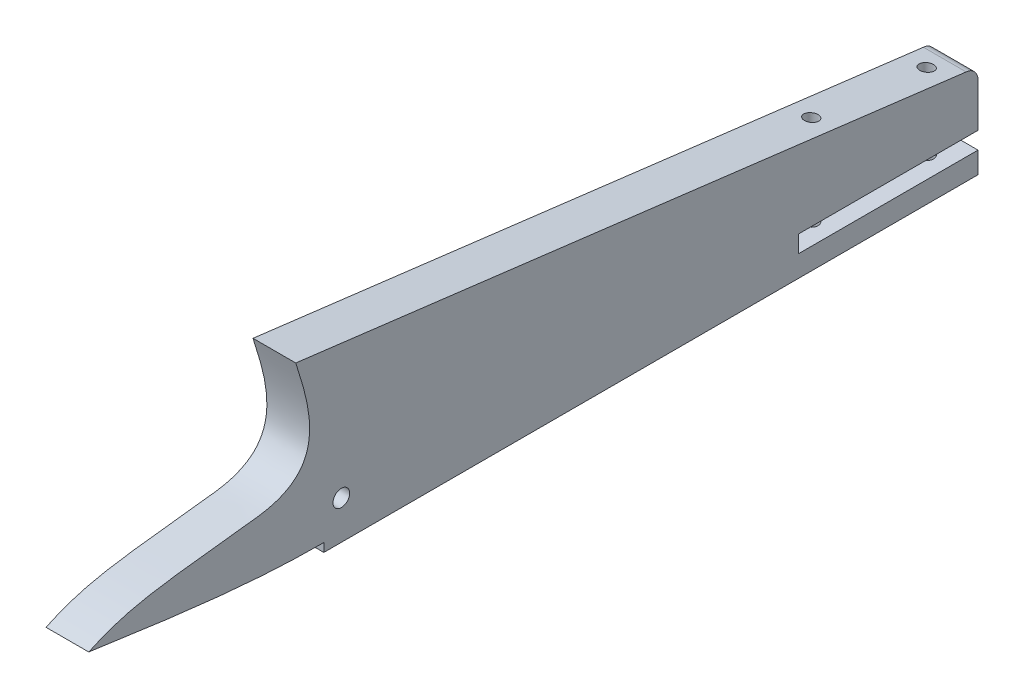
ISO-10303-21;
HEADER;
FILE_DESCRIPTION(('STEP AP214'),'2;1');
FILE_NAME('part.step','',(''),(''),'','','');
FILE_SCHEMA(('AUTOMOTIVE_DESIGN { 1 0 10303 214 1 1 1 1 }'));
ENDSEC;
DATA;
#1=APPLICATION_CONTEXT('core data for automotive mechanical design processes');
#2=APPLICATION_PROTOCOL_DEFINITION('international standard','automotive_design',2000,#1);
#3=PRODUCT_CONTEXT('',#1,'mechanical');
#4=PRODUCT('Part','Part','',(#3));
#5=PRODUCT_RELATED_PRODUCT_CATEGORY('part','',(#4));
#6=PRODUCT_DEFINITION_FORMATION('','',#4);
#7=PRODUCT_DEFINITION_CONTEXT('part definition',#1,'design');
#8=PRODUCT_DEFINITION('design','',#6,#7);
#9=PRODUCT_DEFINITION_SHAPE('','',#8);
#10=(LENGTH_UNIT() NAMED_UNIT(*) SI_UNIT(.MILLI.,.METRE.));
#11=(NAMED_UNIT(*) PLANE_ANGLE_UNIT() SI_UNIT($,.RADIAN.));
#12=(NAMED_UNIT(*) SI_UNIT($,.STERADIAN.) SOLID_ANGLE_UNIT());
#13=UNCERTAINTY_MEASURE_WITH_UNIT(LENGTH_MEASURE(1.E-05),#10,'distance_accuracy_value','');
#14=(GEOMETRIC_REPRESENTATION_CONTEXT(3) GLOBAL_UNCERTAINTY_ASSIGNED_CONTEXT((#13)) GLOBAL_UNIT_ASSIGNED_CONTEXT((#10,
#11,#12)) REPRESENTATION_CONTEXT('',''));
#15=CARTESIAN_POINT('',(0.,0.,0.));
#16=DIRECTION('',(0.,0.,1.));
#17=DIRECTION('',(1.,0.,0.));
#18=AXIS2_PLACEMENT_3D('',#15,#16,#17);
#19=CARTESIAN_POINT('',(10.,3.68129752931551,-119.62378639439));
#20=DIRECTION('',(1.,0.,0.));
#21=DIRECTION('',(0.,0.,-1.));
#22=AXIS2_PLACEMENT_3D('',#19,#20,#21);
#23=PLANE('',#22);
#24=CARTESIAN_POINT('',(10.,7.32944707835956,-92.0180268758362));
#25=CARTESIAN_POINT('',(10.,4.69738072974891,-110.515139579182));
#26=CARTESIAN_POINT('',(10.,2.00959698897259,-128.808948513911));
#27=CARTESIAN_POINT('',(10.,2.,-147.));
#28=B_SPLINE_CURVE_WITH_KNOTS('',3,(#24,#25,#26,#27),.UNSPECIFIED.,.F.,.F.,(4,4),
(0.628986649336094,1.),.UNSPECIFIED.);
#29=CARTESIAN_POINT('',(10.,7.32944707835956,-92.0180268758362));
#30=VERTEX_POINT('',#29);
#31=CARTESIAN_POINT('',(10.,2.,-147.));
#32=VERTEX_POINT('',#31);
#33=EDGE_CURVE('E235',#30,#32,#28,.T.);
#34=ORIENTED_EDGE('',*,*,#33,.T.);
#35=DIRECTION('',(0.,-1.,0.));
#36=VECTOR('',#35,1.);
#37=CARTESIAN_POINT('',(10.,0.,-147.));
#38=LINE('',#37,#36);
#39=CARTESIAN_POINT('',(10.,0.,-147.));
#40=VERTEX_POINT('',#39);
#41=EDGE_CURVE('E243',#32,#40,#38,.T.);
#42=ORIENTED_EDGE('',*,*,#41,.T.);
#43=DIRECTION('',(0.,0.,-1.));
#44=VECTOR('',#43,1.);
#45=CARTESIAN_POINT('',(10.,0.,-300.));
#46=LINE('',#45,#44);
#47=CARTESIAN_POINT('',(10.,0.,-300.));
#48=VERTEX_POINT('',#47);
#49=EDGE_CURVE('E248',#40,#48,#46,.T.);
#50=ORIENTED_EDGE('',*,*,#49,.T.);
#51=DIRECTION('',(0.,1.,0.));
#52=VECTOR('',#51,1.);
#53=CARTESIAN_POINT('',(10.,5.,-300.));
#54=LINE('',#53,#52);
#55=CARTESIAN_POINT('',(10.,5.,-300.));
#56=VERTEX_POINT('',#55);
#57=EDGE_CURVE('E250',#48,#56,#54,.T.);
#58=ORIENTED_EDGE('',*,*,#57,.T.);
#59=DIRECTION('',(0.,0.,1.));
#60=VECTOR('',#59,1.);
#61=CARTESIAN_POINT('',(10.,5.,-258.));
#62=LINE('',#61,#60);
#63=CARTESIAN_POINT('',(10.,5.,-258.));
#64=VERTEX_POINT('',#63);
#65=EDGE_CURVE('E252',#56,#64,#62,.T.);
#66=ORIENTED_EDGE('',*,*,#65,.T.);
#67=DIRECTION('',(0.,1.,0.));
#68=VECTOR('',#67,1.);
#69=CARTESIAN_POINT('',(10.,9.,-258.));
#70=LINE('',#69,#68);
#71=CARTESIAN_POINT('',(10.,9.,-258.));
#72=VERTEX_POINT('',#71);
#73=EDGE_CURVE('E254',#64,#72,#70,.T.);
#74=ORIENTED_EDGE('',*,*,#73,.T.);
#75=DIRECTION('',(0.,0.,-1.));
#76=VECTOR('',#75,1.);
#77=CARTESIAN_POINT('',(10.,9.,-300.));
#78=LINE('',#77,#76);
#79=CARTESIAN_POINT('',(10.,9.,-300.));
#80=VERTEX_POINT('',#79);
#81=EDGE_CURVE('E256',#72,#80,#78,.T.);
#82=ORIENTED_EDGE('',*,*,#81,.T.);
#83=DIRECTION('',(0.,1.,0.));
#84=VECTOR('',#83,1.);
#85=CARTESIAN_POINT('',(10.,19.2277736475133,-300.));
#86=LINE('',#85,#84);
#87=CARTESIAN_POINT('',(10.,19.2277736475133,-300.));
#88=VERTEX_POINT('',#87);
#89=EDGE_CURVE('E258',#80,#88,#86,.T.);
#90=ORIENTED_EDGE('',*,*,#89,.T.);
#91=CARTESIAN_POINT('',(10.,19.2277736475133,-297.));
#92=DIRECTION('',(1.,0.,0.));
#93=DIRECTION('',(0.,0.,1.));
#94=AXIS2_PLACEMENT_3D('',#91,#92,#93);
#95=CIRCLE('',#94,3.);
#96=CARTESIAN_POINT('',(10.,22.2184454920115,-297.236393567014));
#97=VERTEX_POINT('',#96);
#98=EDGE_CURVE('E260',#88,#97,#95,.T.);
#99=ORIENTED_EDGE('',*,*,#98,.T.);
#100=DIRECTION('',(0.,0.123054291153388,0.992399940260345));
#101=VECTOR('',#100,1.);
#102=CARTESIAN_POINT('',(10.,22.2184454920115,-297.236393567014));
#103=LINE('',#102,#101);
#104=CARTESIAN_POINT('',(10.,41.6613306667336,-140.434725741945));
#105=VERTEX_POINT('',#104);
#106=EDGE_CURVE('E262',#97,#105,#103,.T.);
#107=ORIENTED_EDGE('',*,*,#106,.T.);
#108=CARTESIAN_POINT('',(10.,41.6613306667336,-140.434725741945));
#109=CARTESIAN_POINT('',(10.,29.0416337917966,-144.54962945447));
#110=CARTESIAN_POINT('',(10.,16.8225612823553,-147.619938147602));
#111=CARTESIAN_POINT('',(10.,12.2812139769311,-108.316019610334));
#112=CARTESIAN_POINT('',(10.,11.7918969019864,-101.612446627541));
#113=CARTESIAN_POINT('',(10.,7.32944707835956,-92.0180268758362));
#114=B_SPLINE_CURVE_WITH_KNOTS('',3,(#108,#109,#110,#111,#112,#113),.UNSPECIFIED.,.F.,.F.,(4,2,
4),(0.115839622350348,0.48118059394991,0.980332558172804),.UNSPECIFIED.);
#115=EDGE_CURVE('E58',#105,#30,#114,.T.);
#116=ORIENTED_EDGE('',*,*,#115,.T.);
#117=EDGE_LOOP('',(#34,#42,#50,#58,#66,#74,#82,#90,#99,#107,#116));
#118=FACE_BOUND('',#117,.T.);
#119=CARTESIAN_POINT('',(10.,9.,-151.089942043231));
#120=DIRECTION('',(1.,0.,0.));
#121=DIRECTION('',(0.,0.,-1.));
#122=AXIS2_PLACEMENT_3D('',#119,#120,#121);
#123=CIRCLE('',#122,1.95);
#124=CARTESIAN_POINT('',(10.,9.,-153.039942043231));
#125=VERTEX_POINT('',#124);
#126=EDGE_CURVE('E203',#125,#125,#123,.T.);
#127=ORIENTED_EDGE('',*,*,#126,.F.);
#128=EDGE_LOOP('',(#127));
#129=FACE_BOUND('',#128,.T.);
#130=ADVANCED_FACE('F32',(#118,#129),#23,.T.);
#131=CARTESIAN_POINT('',(0.,3.68129752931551,-119.62378639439));
#132=DIRECTION('',(1.,0.,0.));
#133=DIRECTION('',(0.,0.,-1.));
#134=AXIS2_PLACEMENT_3D('',#131,#132,#133);
#135=PLANE('',#134);
#136=CARTESIAN_POINT('',(0.,7.32944707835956,-92.0180268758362));
#137=CARTESIAN_POINT('',(0.,4.69738072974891,-110.515139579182));
#138=CARTESIAN_POINT('',(0.,2.00959698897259,-128.808948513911));
#139=CARTESIAN_POINT('',(0.,2.,-147.));
#140=B_SPLINE_CURVE_WITH_KNOTS('',3,(#136,#137,#138,#139),.UNSPECIFIED.,.F.,.F.,(4,4),
(0.628986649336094,1.),.UNSPECIFIED.);
#141=CARTESIAN_POINT('',(0.,7.32944707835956,-92.0180268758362));
#142=VERTEX_POINT('',#141);
#143=CARTESIAN_POINT('',(0.,2.,-147.));
#144=VERTEX_POINT('',#143);
#145=EDGE_CURVE('E206',#142,#144,#140,.T.);
#146=ORIENTED_EDGE('',*,*,#145,.F.);
#147=CARTESIAN_POINT('',(0.,41.6613306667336,-140.434725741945));
#148=CARTESIAN_POINT('',(0.,29.0416337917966,-144.54962945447));
#149=CARTESIAN_POINT('',(0.,16.8225612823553,-147.619938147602));
#150=CARTESIAN_POINT('',(0.,12.2812139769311,-108.316019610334));
#151=CARTESIAN_POINT('',(0.,11.7918969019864,-101.612446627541));
#152=CARTESIAN_POINT('',(0.,7.32944707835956,-92.0180268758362));
#153=B_SPLINE_CURVE_WITH_KNOTS('',3,(#147,#148,#149,#150,#151,#152),.UNSPECIFIED.,.F.,.F.,(4,2,
4),(0.115839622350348,0.48118059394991,0.980332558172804),.UNSPECIFIED.);
#154=CARTESIAN_POINT('',(0.,41.6613306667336,-140.434725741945));
#155=VERTEX_POINT('',#154);
#156=EDGE_CURVE('E232',#155,#142,#153,.T.);
#157=ORIENTED_EDGE('',*,*,#156,.F.);
#158=DIRECTION('',(0.,0.123054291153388,0.992399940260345));
#159=VECTOR('',#158,1.);
#160=CARTESIAN_POINT('',(0.,22.2184454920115,-297.236393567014));
#161=LINE('',#160,#159);
#162=CARTESIAN_POINT('',(0.,22.2184454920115,-297.236393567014));
#163=VERTEX_POINT('',#162);
#164=EDGE_CURVE('E230',#163,#155,#161,.T.);
#165=ORIENTED_EDGE('',*,*,#164,.F.);
#166=CARTESIAN_POINT('',(0.,19.2277736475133,-297.));
#167=DIRECTION('',(1.,0.,0.));
#168=DIRECTION('',(0.,0.,1.));
#169=AXIS2_PLACEMENT_3D('',#166,#167,#168);
#170=CIRCLE('',#169,3.);
#171=CARTESIAN_POINT('',(0.,19.2277736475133,-300.));
#172=VERTEX_POINT('',#171);
#173=EDGE_CURVE('E228',#172,#163,#170,.T.);
#174=ORIENTED_EDGE('',*,*,#173,.F.);
#175=DIRECTION('',(0.,1.,0.));
#176=VECTOR('',#175,1.);
#177=CARTESIAN_POINT('',(0.,19.2277736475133,-300.));
#178=LINE('',#177,#176);
#179=CARTESIAN_POINT('',(0.,9.,-300.));
#180=VERTEX_POINT('',#179);
#181=EDGE_CURVE('E226',#180,#172,#178,.T.);
#182=ORIENTED_EDGE('',*,*,#181,.F.);
#183=DIRECTION('',(0.,0.,-1.));
#184=VECTOR('',#183,1.);
#185=CARTESIAN_POINT('',(0.,9.,-300.));
#186=LINE('',#185,#184);
#187=CARTESIAN_POINT('',(0.,9.,-258.));
#188=VERTEX_POINT('',#187);
#189=EDGE_CURVE('E224',#188,#180,#186,.T.);
#190=ORIENTED_EDGE('',*,*,#189,.F.);
#191=DIRECTION('',(0.,1.,0.));
#192=VECTOR('',#191,1.);
#193=CARTESIAN_POINT('',(0.,9.,-258.));
#194=LINE('',#193,#192);
#195=CARTESIAN_POINT('',(0.,5.,-258.));
#196=VERTEX_POINT('',#195);
#197=EDGE_CURVE('E222',#196,#188,#194,.T.);
#198=ORIENTED_EDGE('',*,*,#197,.F.);
#199=DIRECTION('',(0.,0.,1.));
#200=VECTOR('',#199,1.);
#201=CARTESIAN_POINT('',(0.,5.,-258.));
#202=LINE('',#201,#200);
#203=CARTESIAN_POINT('',(0.,5.,-300.));
#204=VERTEX_POINT('',#203);
#205=EDGE_CURVE('E220',#204,#196,#202,.T.);
#206=ORIENTED_EDGE('',*,*,#205,.F.);
#207=DIRECTION('',(0.,1.,0.));
#208=VECTOR('',#207,1.);
#209=CARTESIAN_POINT('',(0.,5.,-300.));
#210=LINE('',#209,#208);
#211=CARTESIAN_POINT('',(0.,0.,-300.));
#212=VERTEX_POINT('',#211);
#213=EDGE_CURVE('E218',#212,#204,#210,.T.);
#214=ORIENTED_EDGE('',*,*,#213,.F.);
#215=DIRECTION('',(0.,0.,-1.));
#216=VECTOR('',#215,1.);
#217=CARTESIAN_POINT('',(0.,0.,-300.));
#218=LINE('',#217,#216);
#219=CARTESIAN_POINT('',(0.,0.,-147.));
#220=VERTEX_POINT('',#219);
#221=EDGE_CURVE('E216',#220,#212,#218,.T.);
#222=ORIENTED_EDGE('',*,*,#221,.F.);
#223=DIRECTION('',(0.,-1.,0.));
#224=VECTOR('',#223,1.);
#225=CARTESIAN_POINT('',(0.,0.,-147.));
#226=LINE('',#225,#224);
#227=EDGE_CURVE('E211',#144,#220,#226,.T.);
#228=ORIENTED_EDGE('',*,*,#227,.F.);
#229=EDGE_LOOP('',(#146,#157,#165,#174,#182,#190,#198,#206,#214,#222,#228));
#230=FACE_BOUND('',#229,.T.);
#231=CARTESIAN_POINT('',(0.,9.,-151.089942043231));
#232=DIRECTION('',(1.,0.,0.));
#233=DIRECTION('',(0.,0.,-1.));
#234=AXIS2_PLACEMENT_3D('',#231,#232,#233);
#235=CIRCLE('',#234,1.95);
#236=CARTESIAN_POINT('',(0.,9.,-153.039942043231));
#237=VERTEX_POINT('',#236);
#238=EDGE_CURVE('E200',#237,#237,#235,.T.);
#239=ORIENTED_EDGE('',*,*,#238,.T.);
#240=EDGE_LOOP('',(#239));
#241=FACE_BOUND('',#240,.T.);
#242=ADVANCED_FACE('F318',(#230,#241),#135,.F.);
#243=DIRECTION('',(-1.,0.,0.));
#244=VECTOR('',#243,1.);
#245=SURFACE_OF_LINEAR_EXTRUSION('',#28,#244);
#246=ORIENTED_EDGE('',*,*,#145,.T.);
#247=DIRECTION('',(-1.,0.,0.));
#248=VECTOR('',#247,1.);
#249=CARTESIAN_POINT('',(10.,2.,-147.));
#250=LINE('',#249,#248);
#251=EDGE_CURVE('E11',#32,#144,#250,.T.);
#252=ORIENTED_EDGE('',*,*,#251,.F.);
#253=ORIENTED_EDGE('',*,*,#33,.F.);
#254=DIRECTION('',(-1.,0.,0.));
#255=VECTOR('',#254,1.);
#256=CARTESIAN_POINT('',(10.,7.32944707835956,-92.0180268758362));
#257=LINE('',#256,#255);
#258=EDGE_CURVE('E268',#30,#142,#257,.T.);
#259=ORIENTED_EDGE('',*,*,#258,.T.);
#260=EDGE_LOOP('',(#246,#252,#253,#259));
#261=FACE_BOUND('',#260,.T.);
#262=ADVANCED_FACE('F34',(#261),#245,.F.);
#263=CARTESIAN_POINT('',(10.,0.,-147.));
#264=DIRECTION('',(0.,0.,-1.));
#265=DIRECTION('',(0.,1.,0.));
#266=AXIS2_PLACEMENT_3D('',#263,#264,#265);
#267=PLANE('',#266);
#268=ORIENTED_EDGE('',*,*,#227,.T.);
#269=DIRECTION('',(-1.,0.,0.));
#270=VECTOR('',#269,1.);
#271=CARTESIAN_POINT('',(10.,0.,-147.));
#272=LINE('',#271,#270);
#273=EDGE_CURVE('E42',#40,#220,#272,.T.);
#274=ORIENTED_EDGE('',*,*,#273,.F.);
#275=ORIENTED_EDGE('',*,*,#41,.F.);
#276=ORIENTED_EDGE('',*,*,#251,.T.);
#277=EDGE_LOOP('',(#268,#274,#275,#276));
#278=FACE_BOUND('',#277,.T.);
#279=ADVANCED_FACE('F311',(#278),#267,.F.);
#280=CARTESIAN_POINT('',(10.,0.,-300.));
#281=DIRECTION('',(0.,1.,0.));
#282=DIRECTION('',(0.,0.,1.));
#283=AXIS2_PLACEMENT_3D('',#280,#281,#282);
#284=PLANE('',#283);
#285=DIRECTION('',(1.,0.,0.));
#286=VECTOR('',#285,1.);
#287=CARTESIAN_POINT('',(2.5,0.,-250.5));
#288=LINE('',#287,#286);
#289=CARTESIAN_POINT('',(2.5,0.,-250.5));
#290=VERTEX_POINT('',#289);
#291=CARTESIAN_POINT('',(7.5,0.,-250.5));
#292=VERTEX_POINT('',#291);
#293=EDGE_CURVE('E172',#290,#292,#288,.T.);
#294=ORIENTED_EDGE('',*,*,#293,.F.);
#295=CARTESIAN_POINT('',(2.5,0.,-250.));
#296=DIRECTION('',(0.,-1.,0.));
#297=DIRECTION('',(0.,0.,-1.));
#298=AXIS2_PLACEMENT_3D('',#295,#296,#297);
#299=CIRCLE('',#298,0.5);
#300=CARTESIAN_POINT('',(2.5,0.,-249.5));
#301=VERTEX_POINT('',#300);
#302=EDGE_CURVE('E50',#301,#290,#299,.T.);
#303=ORIENTED_EDGE('',*,*,#302,.F.);
#304=DIRECTION('',(-1.,0.,0.));
#305=VECTOR('',#304,1.);
#306=CARTESIAN_POINT('',(7.5,0.,-249.5));
#307=LINE('',#306,#305);
#308=CARTESIAN_POINT('',(7.5,0.,-249.5));
#309=VERTEX_POINT('',#308);
#310=EDGE_CURVE('E163',#309,#301,#307,.T.);
#311=ORIENTED_EDGE('',*,*,#310,.F.);
#312=CARTESIAN_POINT('',(7.5,0.,-250.));
#313=DIRECTION('',(0.,-1.,0.));
#314=DIRECTION('',(0.,0.,-1.));
#315=AXIS2_PLACEMENT_3D('',#312,#313,#314);
#316=CIRCLE('',#315,0.5);
#317=EDGE_CURVE('E166',#292,#309,#316,.T.);
#318=ORIENTED_EDGE('',*,*,#317,.F.);
#319=EDGE_LOOP('',(#294,#303,#311,#318));
#320=FACE_BOUND('',#319,.T.);
#321=CARTESIAN_POINT('',(5.,0.,-266.));
#322=DIRECTION('',(0.,-1.,0.));
#323=DIRECTION('',(0.,0.,-1.));
#324=AXIS2_PLACEMENT_3D('',#321,#322,#323);
#325=CIRCLE('',#324,1.6);
#326=CARTESIAN_POINT('',(5.,0.,-267.6));
#327=VERTEX_POINT('',#326);
#328=EDGE_CURVE('E178',#327,#327,#325,.T.);
#329=ORIENTED_EDGE('',*,*,#328,.F.);
#330=EDGE_LOOP('',(#329));
#331=FACE_BOUND('',#330,.T.);
#332=CARTESIAN_POINT('',(5.,0.,-293.));
#333=DIRECTION('',(0.,-1.,0.));
#334=DIRECTION('',(0.,0.,-1.));
#335=AXIS2_PLACEMENT_3D('',#332,#333,#334);
#336=CIRCLE('',#335,1.6);
#337=CARTESIAN_POINT('',(5.,0.,-294.6));
#338=VERTEX_POINT('',#337);
#339=EDGE_CURVE('E190',#338,#338,#336,.T.);
#340=ORIENTED_EDGE('',*,*,#339,.F.);
#341=EDGE_LOOP('',(#340));
#342=FACE_BOUND('',#341,.T.);
#343=ORIENTED_EDGE('',*,*,#221,.T.);
#344=DIRECTION('',(-1.,0.,0.));
#345=VECTOR('',#344,1.);
#346=CARTESIAN_POINT('',(10.,0.,-300.));
#347=LINE('',#346,#345);
#348=EDGE_CURVE('E542',#48,#212,#347,.T.);
#349=ORIENTED_EDGE('',*,*,#348,.F.);
#350=ORIENTED_EDGE('',*,*,#49,.F.);
#351=ORIENTED_EDGE('',*,*,#273,.T.);
#352=EDGE_LOOP('',(#343,#349,#350,#351));
#353=FACE_BOUND('',#352,.T.);
#354=ADVANCED_FACE('F308',(#320,#331,#342,#353),#284,.F.);
#355=CARTESIAN_POINT('',(10.,5.,-300.));
#356=DIRECTION('',(0.,0.,1.));
#357=DIRECTION('',(1.,0.,0.));
#358=AXIS2_PLACEMENT_3D('',#355,#356,#357);
#359=PLANE('',#358);
#360=ORIENTED_EDGE('',*,*,#213,.T.);
#361=DIRECTION('',(-1.,0.,0.));
#362=VECTOR('',#361,1.);
#363=CARTESIAN_POINT('',(10.,5.,-300.));
#364=LINE('',#363,#362);
#365=EDGE_CURVE('E539',#56,#204,#364,.T.);
#366=ORIENTED_EDGE('',*,*,#365,.F.);
#367=ORIENTED_EDGE('',*,*,#57,.F.);
#368=ORIENTED_EDGE('',*,*,#348,.T.);
#369=EDGE_LOOP('',(#360,#366,#367,#368));
#370=FACE_BOUND('',#369,.T.);
#371=ADVANCED_FACE('F304',(#370),#359,.F.);
#372=CARTESIAN_POINT('',(10.,5.,-258.));
#373=DIRECTION('',(0.,-1.,0.));
#374=DIRECTION('',(0.,0.,-1.));
#375=AXIS2_PLACEMENT_3D('',#372,#373,#374);
#376=PLANE('',#375);
#377=CARTESIAN_POINT('',(5.,5.,-266.));
#378=DIRECTION('',(0.,-1.,0.));
#379=DIRECTION('',(0.,0.,-1.));
#380=AXIS2_PLACEMENT_3D('',#377,#378,#379);
#381=CIRCLE('',#380,1.6);
#382=CARTESIAN_POINT('',(5.,5.,-267.6));
#383=VERTEX_POINT('',#382);
#384=EDGE_CURVE('E187',#383,#383,#381,.T.);
#385=ORIENTED_EDGE('',*,*,#384,.T.);
#386=EDGE_LOOP('',(#385));
#387=FACE_BOUND('',#386,.T.);
#388=CARTESIAN_POINT('',(5.,5.,-293.));
#389=DIRECTION('',(0.,-1.,0.));
#390=DIRECTION('',(0.,0.,-1.));
#391=AXIS2_PLACEMENT_3D('',#388,#389,#390);
#392=CIRCLE('',#391,1.6);
#393=CARTESIAN_POINT('',(5.,5.,-294.6));
#394=VERTEX_POINT('',#393);
#395=EDGE_CURVE('E197',#394,#394,#392,.T.);
#396=ORIENTED_EDGE('',*,*,#395,.T.);
#397=EDGE_LOOP('',(#396));
#398=FACE_BOUND('',#397,.T.);
#399=ORIENTED_EDGE('',*,*,#205,.T.);
#400=DIRECTION('',(-1.,0.,0.));
#401=VECTOR('',#400,1.);
#402=CARTESIAN_POINT('',(10.,5.,-258.));
#403=LINE('',#402,#401);
#404=EDGE_CURVE('E536',#64,#196,#403,.T.);
#405=ORIENTED_EDGE('',*,*,#404,.F.);
#406=ORIENTED_EDGE('',*,*,#65,.F.);
#407=ORIENTED_EDGE('',*,*,#365,.T.);
#408=EDGE_LOOP('',(#399,#405,#406,#407));
#409=FACE_BOUND('',#408,.T.);
#410=ADVANCED_FACE('F300',(#387,#398,#409),#376,.F.);
#411=CARTESIAN_POINT('',(10.,9.,-258.));
#412=DIRECTION('',(0.,0.,1.));
#413=DIRECTION('',(1.,0.,0.));
#414=AXIS2_PLACEMENT_3D('',#411,#412,#413);
#415=PLANE('',#414);
#416=ORIENTED_EDGE('',*,*,#197,.T.);
#417=DIRECTION('',(-1.,0.,0.));
#418=VECTOR('',#417,1.);
#419=CARTESIAN_POINT('',(10.,9.,-258.));
#420=LINE('',#419,#418);
#421=EDGE_CURVE('E512',#72,#188,#420,.T.);
#422=ORIENTED_EDGE('',*,*,#421,.F.);
#423=ORIENTED_EDGE('',*,*,#73,.F.);
#424=ORIENTED_EDGE('',*,*,#404,.T.);
#425=EDGE_LOOP('',(#416,#422,#423,#424));
#426=FACE_BOUND('',#425,.T.);
#427=ADVANCED_FACE('F296',(#426),#415,.F.);
#428=CARTESIAN_POINT('',(10.,9.,-300.));
#429=DIRECTION('',(0.,1.,0.));
#430=DIRECTION('',(0.,0.,1.));
#431=AXIS2_PLACEMENT_3D('',#428,#429,#430);
#432=PLANE('',#431);
#433=CARTESIAN_POINT('',(5.,9.,-266.));
#434=DIRECTION('',(0.,1.,0.));
#435=DIRECTION('',(0.,0.,1.));
#436=AXIS2_PLACEMENT_3D('',#433,#434,#435);
#437=CIRCLE('',#436,1.6);
#438=CARTESIAN_POINT('',(5.,9.,-264.4));
#439=VERTEX_POINT('',#438);
#440=EDGE_CURVE('E184',#439,#439,#437,.T.);
#441=ORIENTED_EDGE('',*,*,#440,.T.);
#442=EDGE_LOOP('',(#441));
#443=FACE_BOUND('',#442,.T.);
#444=CARTESIAN_POINT('',(5.,9.,-293.));
#445=DIRECTION('',(0.,1.,0.));
#446=DIRECTION('',(0.,0.,1.));
#447=AXIS2_PLACEMENT_3D('',#444,#445,#446);
#448=CIRCLE('',#447,1.6);
#449=CARTESIAN_POINT('',(5.,9.,-291.4));
#450=VERTEX_POINT('',#449);
#451=EDGE_CURVE('E194',#450,#450,#448,.T.);
#452=ORIENTED_EDGE('',*,*,#451,.T.);
#453=EDGE_LOOP('',(#452));
#454=FACE_BOUND('',#453,.T.);
#455=ORIENTED_EDGE('',*,*,#189,.T.);
#456=DIRECTION('',(-1.,0.,0.));
#457=VECTOR('',#456,1.);
#458=CARTESIAN_POINT('',(10.,9.,-300.));
#459=LINE('',#458,#457);
#460=EDGE_CURVE('E509',#80,#180,#459,.T.);
#461=ORIENTED_EDGE('',*,*,#460,.F.);
#462=ORIENTED_EDGE('',*,*,#81,.F.);
#463=ORIENTED_EDGE('',*,*,#421,.T.);
#464=EDGE_LOOP('',(#455,#461,#462,#463));
#465=FACE_BOUND('',#464,.T.);
#466=ADVANCED_FACE('F292',(#443,#454,#465),#432,.F.);
#467=CARTESIAN_POINT('',(10.,19.2277736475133,-300.));
#468=DIRECTION('',(0.,0.,1.));
#469=DIRECTION('',(1.,0.,0.));
#470=AXIS2_PLACEMENT_3D('',#467,#468,#469);
#471=PLANE('',#470);
#472=ORIENTED_EDGE('',*,*,#181,.T.);
#473=DIRECTION('',(-1.,0.,0.));
#474=VECTOR('',#473,1.);
#475=CARTESIAN_POINT('',(10.,19.2277736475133,-300.));
#476=LINE('',#475,#474);
#477=EDGE_CURVE('E517',#88,#172,#476,.T.);
#478=ORIENTED_EDGE('',*,*,#477,.F.);
#479=ORIENTED_EDGE('',*,*,#89,.F.);
#480=ORIENTED_EDGE('',*,*,#460,.T.);
#481=EDGE_LOOP('',(#472,#478,#479,#480));
#482=FACE_BOUND('',#481,.T.);
#483=ADVANCED_FACE('F288',(#482),#471,.F.);
#484=CARTESIAN_POINT('',(10.,19.2277736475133,-297.));
#485=DIRECTION('',(-1.,0.,0.));
#486=DIRECTION('',(0.,0.,1.));
#487=AXIS2_PLACEMENT_3D('',#484,#485,#486);
#488=CYLINDRICAL_SURFACE('',#487,3.);
#489=ORIENTED_EDGE('',*,*,#173,.T.);
#490=DIRECTION('',(-1.,0.,0.));
#491=VECTOR('',#490,1.);
#492=CARTESIAN_POINT('',(10.,22.2184454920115,-297.236393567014));
#493=LINE('',#492,#491);
#494=EDGE_CURVE('E526',#97,#163,#493,.T.);
#495=ORIENTED_EDGE('',*,*,#494,.F.);
#496=ORIENTED_EDGE('',*,*,#98,.F.);
#497=ORIENTED_EDGE('',*,*,#477,.T.);
#498=EDGE_LOOP('',(#489,#495,#496,#497));
#499=FACE_BOUND('',#498,.T.);
#500=ADVANCED_FACE('F284',(#499),#488,.T.);
#501=CARTESIAN_POINT('',(10.,22.2184454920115,-297.236393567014));
#502=DIRECTION('',(0.,-0.992399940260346,0.123054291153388));
#503=DIRECTION('',(0.,-0.123054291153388,-0.992399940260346));
#504=AXIS2_PLACEMENT_3D('',#501,#502,#503);
#505=PLANE('',#504);
#506=CARTESIAN_POINT('',(5.,26.0916543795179,-266.));
#507=DIRECTION('',(0.,-0.992399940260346,0.123054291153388));
#508=DIRECTION('',(0.,-0.123054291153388,-0.992399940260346));
#509=AXIS2_PLACEMENT_3D('',#506,#507,#508);
#510=ELLIPSE('',#509,1.61225322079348,1.6);
#511=CARTESIAN_POINT('',(5.,25.8932597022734,-267.6));
#512=VERTEX_POINT('',#511);
#513=EDGE_CURVE('E37',#512,#512,#510,.T.);
#514=ORIENTED_EDGE('',*,*,#513,.T.);
#515=EDGE_LOOP('',(#514));
#516=FACE_BOUND('',#515,.T.);
#517=CARTESIAN_POINT('',(5.,22.7437442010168,-293.));
#518=DIRECTION('',(0.,-0.992399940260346,0.123054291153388));
#519=DIRECTION('',(0.,-0.123054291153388,-0.992399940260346));
#520=AXIS2_PLACEMENT_3D('',#517,#518,#519);
#521=ELLIPSE('',#520,1.61225322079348,1.6);
#522=CARTESIAN_POINT('',(5.,22.5453495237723,-294.6));
#523=VERTEX_POINT('',#522);
#524=EDGE_CURVE('E193',#523,#523,#521,.T.);
#525=ORIENTED_EDGE('',*,*,#524,.T.);
#526=EDGE_LOOP('',(#525));
#527=FACE_BOUND('',#526,.T.);
#528=ORIENTED_EDGE('',*,*,#164,.T.);
#529=DIRECTION('',(-1.,0.,0.));
#530=VECTOR('',#529,1.);
#531=CARTESIAN_POINT('',(10.,41.6613306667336,-140.434725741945));
#532=LINE('',#531,#530);
#533=EDGE_CURVE('E531',#105,#155,#532,.T.);
#534=ORIENTED_EDGE('',*,*,#533,.F.);
#535=ORIENTED_EDGE('',*,*,#106,.F.);
#536=ORIENTED_EDGE('',*,*,#494,.T.);
#537=EDGE_LOOP('',(#528,#534,#535,#536));
#538=FACE_BOUND('',#537,.T.);
#539=ADVANCED_FACE('F279',(#516,#527,#538),#505,.F.);
#540=DIRECTION('',(-1.,0.,0.));
#541=VECTOR('',#540,1.);
#542=SURFACE_OF_LINEAR_EXTRUSION('',#114,#541);
#543=ORIENTED_EDGE('',*,*,#156,.T.);
#544=ORIENTED_EDGE('',*,*,#258,.F.);
#545=ORIENTED_EDGE('',*,*,#115,.F.);
#546=ORIENTED_EDGE('',*,*,#533,.T.);
#547=EDGE_LOOP('',(#543,#544,#545,#546));
#548=FACE_BOUND('',#547,.T.);
#549=ADVANCED_FACE('F274',(#548),#542,.F.);
#550=CARTESIAN_POINT('',(10.,9.,-151.089942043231));
#551=DIRECTION('',(-1.,0.,0.));
#552=DIRECTION('',(0.,0.,1.));
#553=AXIS2_PLACEMENT_3D('',#550,#551,#552);
#554=CYLINDRICAL_SURFACE('',#553,1.95);
#555=ORIENTED_EDGE('',*,*,#126,.T.);
#556=EDGE_LOOP('',(#555));
#557=FACE_BOUND('',#556,.T.);
#558=ORIENTED_EDGE('',*,*,#238,.F.);
#559=EDGE_LOOP('',(#558));
#560=FACE_BOUND('',#559,.T.);
#561=ADVANCED_FACE('F278',(#557,#560),#554,.F.);
#562=CARTESIAN_POINT('',(5.,28.,-293.));
#563=DIRECTION('',(0.,-1.,0.));
#564=DIRECTION('',(0.,0.,-1.));
#565=AXIS2_PLACEMENT_3D('',#562,#563,#564);
#566=CYLINDRICAL_SURFACE('',#565,1.6);
#567=ORIENTED_EDGE('',*,*,#524,.F.);
#568=EDGE_LOOP('',(#567));
#569=FACE_BOUND('',#568,.T.);
#570=ORIENTED_EDGE('',*,*,#451,.F.);
#571=EDGE_LOOP('',(#570));
#572=FACE_BOUND('',#571,.T.);
#573=ADVANCED_FACE('F332',(#569,#572),#566,.F.);
#574=ORIENTED_EDGE('',*,*,#339,.T.);
#575=EDGE_LOOP('',(#574));
#576=FACE_BOUND('',#575,.T.);
#577=ORIENTED_EDGE('',*,*,#395,.F.);
#578=EDGE_LOOP('',(#577));
#579=FACE_BOUND('',#578,.T.);
#580=ADVANCED_FACE('F339',(#576,#579),#566,.F.);
#581=CARTESIAN_POINT('',(5.,28.,-266.));
#582=DIRECTION('',(0.,-1.,0.));
#583=DIRECTION('',(0.,0.,-1.));
#584=AXIS2_PLACEMENT_3D('',#581,#582,#583);
#585=CYLINDRICAL_SURFACE('',#584,1.6);
#586=ORIENTED_EDGE('',*,*,#513,.F.);
#587=EDGE_LOOP('',(#586));
#588=FACE_BOUND('',#587,.T.);
#589=ORIENTED_EDGE('',*,*,#440,.F.);
#590=EDGE_LOOP('',(#589));
#591=FACE_BOUND('',#590,.T.);
#592=ADVANCED_FACE('F344',(#588,#591),#585,.F.);
#593=ORIENTED_EDGE('',*,*,#328,.T.);
#594=EDGE_LOOP('',(#593));
#595=FACE_BOUND('',#594,.T.);
#596=ORIENTED_EDGE('',*,*,#384,.F.);
#597=EDGE_LOOP('',(#596));
#598=FACE_BOUND('',#597,.T.);
#599=ADVANCED_FACE('F346',(#595,#598),#585,.F.);
#600=CARTESIAN_POINT('',(2.5,8.,-250.));
#601=DIRECTION('',(0.,-1.,0.));
#602=DIRECTION('',(0.,0.,-1.));
#603=AXIS2_PLACEMENT_3D('',#600,#601,#602);
#604=CYLINDRICAL_SURFACE('',#603,0.5);
#605=ORIENTED_EDGE('',*,*,#302,.T.);
#606=DIRECTION('',(0.,-1.,0.));
#607=VECTOR('',#606,1.);
#608=CARTESIAN_POINT('',(2.5,8.,-250.5));
#609=LINE('',#608,#607);
#610=CARTESIAN_POINT('',(2.5,8.,-250.5));
#611=VERTEX_POINT('',#610);
#612=EDGE_CURVE('E141',#611,#290,#609,.T.);
#613=ORIENTED_EDGE('',*,*,#612,.F.);
#614=CARTESIAN_POINT('',(2.5,8.,-250.));
#615=DIRECTION('',(0.,-1.,0.));
#616=DIRECTION('',(0.,0.,-1.));
#617=AXIS2_PLACEMENT_3D('',#614,#615,#616);
#618=CIRCLE('',#617,0.5);
#619=CARTESIAN_POINT('',(2.5,8.,-249.5));
#620=VERTEX_POINT('',#619);
#621=EDGE_CURVE('E145',#620,#611,#618,.T.);
#622=ORIENTED_EDGE('',*,*,#621,.F.);
#623=DIRECTION('',(0.,-1.,0.));
#624=VECTOR('',#623,1.);
#625=CARTESIAN_POINT('',(2.5,8.,-249.5));
#626=LINE('',#625,#624);
#627=EDGE_CURVE('E176',#620,#301,#626,.T.);
#628=ORIENTED_EDGE('',*,*,#627,.T.);
#629=EDGE_LOOP('',(#605,#613,#622,#628));
#630=FACE_BOUND('',#629,.T.);
#631=ADVANCED_FACE('F143',(#630),#604,.F.);
#632=CARTESIAN_POINT('',(7.5,8.,-249.5));
#633=DIRECTION('',(0.,0.,1.));
#634=DIRECTION('',(1.,0.,0.));
#635=AXIS2_PLACEMENT_3D('',#632,#633,#634);
#636=PLANE('',#635);
#637=ORIENTED_EDGE('',*,*,#310,.T.);
#638=ORIENTED_EDGE('',*,*,#627,.F.);
#639=DIRECTION('',(-1.,0.,0.));
#640=VECTOR('',#639,1.);
#641=CARTESIAN_POINT('',(7.5,8.,-249.5));
#642=LINE('',#641,#640);
#643=CARTESIAN_POINT('',(7.5,8.,-249.5));
#644=VERTEX_POINT('',#643);
#645=EDGE_CURVE('E151',#644,#620,#642,.T.);
#646=ORIENTED_EDGE('',*,*,#645,.F.);
#647=DIRECTION('',(0.,-1.,0.));
#648=VECTOR('',#647,1.);
#649=CARTESIAN_POINT('',(7.5,8.,-249.5));
#650=LINE('',#649,#648);
#651=EDGE_CURVE('E179',#644,#309,#650,.T.);
#652=ORIENTED_EDGE('',*,*,#651,.T.);
#653=EDGE_LOOP('',(#637,#638,#646,#652));
#654=FACE_BOUND('',#653,.T.);
#655=ADVANCED_FACE('F352',(#654),#636,.F.);
#656=CARTESIAN_POINT('',(7.5,8.,-250.));
#657=DIRECTION('',(0.,-1.,0.));
#658=DIRECTION('',(0.,0.,-1.));
#659=AXIS2_PLACEMENT_3D('',#656,#657,#658);
#660=CYLINDRICAL_SURFACE('',#659,0.5);
#661=ORIENTED_EDGE('',*,*,#317,.T.);
#662=ORIENTED_EDGE('',*,*,#651,.F.);
#663=CARTESIAN_POINT('',(7.5,8.,-250.));
#664=DIRECTION('',(0.,-1.,0.));
#665=DIRECTION('',(0.,0.,-1.));
#666=AXIS2_PLACEMENT_3D('',#663,#664,#665);
#667=CIRCLE('',#666,0.5);
#668=CARTESIAN_POINT('',(7.5,8.,-250.5));
#669=VERTEX_POINT('',#668);
#670=EDGE_CURVE('E159',#669,#644,#667,.T.);
#671=ORIENTED_EDGE('',*,*,#670,.F.);
#672=DIRECTION('',(0.,-1.,0.));
#673=VECTOR('',#672,1.);
#674=CARTESIAN_POINT('',(7.5,8.,-250.5));
#675=LINE('',#674,#673);
#676=EDGE_CURVE('E150',#669,#292,#675,.T.);
#677=ORIENTED_EDGE('',*,*,#676,.T.);
#678=EDGE_LOOP('',(#661,#662,#671,#677));
#679=FACE_BOUND('',#678,.T.);
#680=ADVANCED_FACE('F355',(#679),#660,.F.);
#681=CARTESIAN_POINT('',(2.5,8.,-250.5));
#682=DIRECTION('',(0.,0.,-1.));
#683=DIRECTION('',(-1.,0.,0.));
#684=AXIS2_PLACEMENT_3D('',#681,#682,#683);
#685=PLANE('',#684);
#686=ORIENTED_EDGE('',*,*,#293,.T.);
#687=ORIENTED_EDGE('',*,*,#676,.F.);
#688=DIRECTION('',(1.,0.,0.));
#689=VECTOR('',#688,1.);
#690=CARTESIAN_POINT('',(2.5,8.,-250.5));
#691=LINE('',#690,#689);
#692=EDGE_CURVE('E154',#611,#669,#691,.T.);
#693=ORIENTED_EDGE('',*,*,#692,.F.);
#694=ORIENTED_EDGE('',*,*,#612,.T.);
#695=EDGE_LOOP('',(#686,#687,#693,#694));
#696=FACE_BOUND('',#695,.T.);
#697=ADVANCED_FACE('F155',(#696),#685,.F.);
#698=CARTESIAN_POINT('',(2.5,8.,-250.));
#699=DIRECTION('',(0.,-1.,0.));
#700=DIRECTION('',(0.,0.,-1.));
#701=AXIS2_PLACEMENT_3D('',#698,#699,#700);
#702=PLANE('',#701);
#703=ORIENTED_EDGE('',*,*,#621,.T.);
#704=ORIENTED_EDGE('',*,*,#692,.T.);
#705=ORIENTED_EDGE('',*,*,#670,.T.);
#706=ORIENTED_EDGE('',*,*,#645,.T.);
#707=EDGE_LOOP('',(#703,#704,#705,#706));
#708=FACE_BOUND('',#707,.T.);
#709=ADVANCED_FACE('F161',(#708),#702,.T.);
#710=CLOSED_SHELL('',(#130,#242,#262,#279,#354,#371,#410,#427,#466,#483,#500,#539,#549,#561,
#573,#580,#592,#599,#631,#655,#680,#697,#709));
#711=MANIFOLD_SOLID_BREP('B2',#710);
#712=ADVANCED_BREP_SHAPE_REPRESENTATION('',(#18,#711),#14);
#713=SHAPE_DEFINITION_REPRESENTATION(#9,#712);
ENDSEC;
END-ISO-10303-21;
